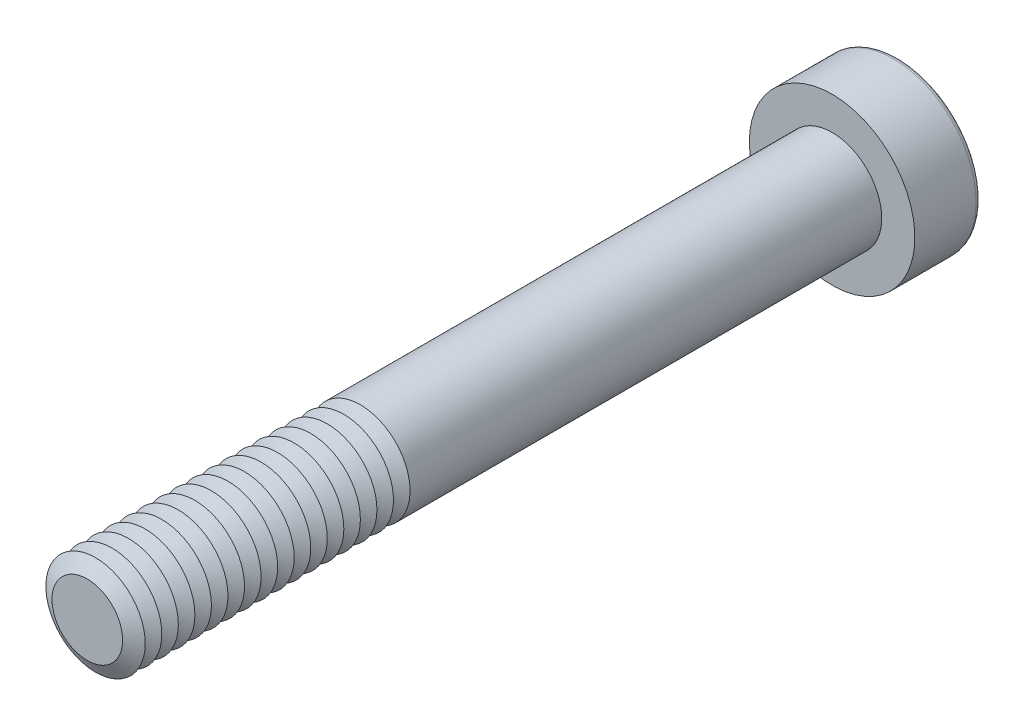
ISO-10303-21;
HEADER;
FILE_DESCRIPTION(('STEP AP214'),'2;1');
FILE_NAME('part.step','',(''),(''),'','','');
FILE_SCHEMA(('AUTOMOTIVE_DESIGN { 1 0 10303 214 1 1 1 1 }'));
ENDSEC;
DATA;
#1=APPLICATION_CONTEXT('core data for automotive mechanical design processes');
#2=APPLICATION_PROTOCOL_DEFINITION('international standard','automotive_design',2000,#1);
#3=PRODUCT_CONTEXT('',#1,'mechanical');
#4=PRODUCT('Part','Part','',(#3));
#5=PRODUCT_RELATED_PRODUCT_CATEGORY('part','',(#4));
#6=PRODUCT_DEFINITION_FORMATION('','',#4);
#7=PRODUCT_DEFINITION_CONTEXT('part definition',#1,'design');
#8=PRODUCT_DEFINITION('design','',#6,#7);
#9=PRODUCT_DEFINITION_SHAPE('','',#8);
#10=(LENGTH_UNIT() NAMED_UNIT(*) SI_UNIT(.MILLI.,.METRE.));
#11=(NAMED_UNIT(*) PLANE_ANGLE_UNIT() SI_UNIT($,.RADIAN.));
#12=(NAMED_UNIT(*) SI_UNIT($,.STERADIAN.) SOLID_ANGLE_UNIT());
#13=UNCERTAINTY_MEASURE_WITH_UNIT(LENGTH_MEASURE(1.E-05),#10,'distance_accuracy_value','');
#14=(GEOMETRIC_REPRESENTATION_CONTEXT(3) GLOBAL_UNCERTAINTY_ASSIGNED_CONTEXT((#13)) GLOBAL_UNIT_ASSIGNED_CONTEXT((#10,
#11,#12)) REPRESENTATION_CONTEXT('',''));
#15=CARTESIAN_POINT('',(0.,0.,0.));
#16=DIRECTION('',(0.,0.,1.));
#17=DIRECTION('',(1.,0.,0.));
#18=AXIS2_PLACEMENT_3D('',#15,#16,#17);
#19=CARTESIAN_POINT('',(0.,0.,41.5));
#20=DIRECTION('',(0.,0.,1.));
#21=DIRECTION('',(1.,0.,0.));
#22=AXIS2_PLACEMENT_3D('',#19,#20,#21);
#23=CONICAL_SURFACE('',#22,3.,1.0471975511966);
#24=CARTESIAN_POINT('',(0.,0.,41.));
#25=DIRECTION('',(0.,0.,1.));
#26=DIRECTION('',(1.,0.,0.));
#27=AXIS2_PLACEMENT_3D('',#24,#25,#26);
#28=CIRCLE('',#27,2.13397459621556);
#29=CARTESIAN_POINT('',(2.13397459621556,0.,41.));
#30=VERTEX_POINT('',#29);
#31=EDGE_CURVE('E314',#30,#30,#28,.T.);
#32=ORIENTED_EDGE('',*,*,#31,.T.);
#33=EDGE_LOOP('',(#32));
#34=FACE_BOUND('',#33,.T.);
#35=CARTESIAN_POINT('',(0.,0.,41.5));
#36=DIRECTION('',(0.,0.,1.));
#37=DIRECTION('',(1.,0.,0.));
#38=AXIS2_PLACEMENT_3D('',#35,#36,#37);
#39=CIRCLE('',#38,3.);
#40=CARTESIAN_POINT('',(3.,0.,41.5));
#41=VERTEX_POINT('',#40);
#42=EDGE_CURVE('E317',#41,#41,#39,.T.);
#43=ORIENTED_EDGE('',*,*,#42,.F.);
#44=EDGE_LOOP('',(#43));
#45=FACE_BOUND('',#44,.T.);
#46=ADVANCED_FACE('F39',(#34,#45),#23,.T.);
#47=CARTESIAN_POINT('',(0.,0.,41.));
#48=DIRECTION('',(0.,0.,-1.));
#49=DIRECTION('',(-1.,0.,0.));
#50=AXIS2_PLACEMENT_3D('',#47,#48,#49);
#51=CONICAL_SURFACE('',#50,2.13397459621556,1.0471975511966);
#52=CARTESIAN_POINT('',(0.,0.,40.5));
#53=DIRECTION('',(0.,0.,1.));
#54=DIRECTION('',(1.,0.,0.));
#55=AXIS2_PLACEMENT_3D('',#52,#53,#54);
#56=CIRCLE('',#55,3.);
#57=CARTESIAN_POINT('',(3.,0.,40.5));
#58=VERTEX_POINT('',#57);
#59=EDGE_CURVE('E325',#58,#58,#56,.T.);
#60=ORIENTED_EDGE('',*,*,#59,.T.);
#61=EDGE_LOOP('',(#60));
#62=FACE_BOUND('',#61,.T.);
#63=ORIENTED_EDGE('',*,*,#31,.F.);
#64=EDGE_LOOP('',(#63));
#65=FACE_BOUND('',#64,.T.);
#66=ADVANCED_FACE('F245',(#62,#65),#51,.T.);
#67=CARTESIAN_POINT('',(0.,0.,45.));
#68=DIRECTION('',(0.,0.,1.));
#69=DIRECTION('',(1.,0.,0.));
#70=AXIS2_PLACEMENT_3D('',#67,#68,#69);
#71=PLANE('',#70);
#72=CARTESIAN_POINT('',(0.,0.,45.));
#73=DIRECTION('',(0.,0.,1.));
#74=DIRECTION('',(1.,0.,0.));
#75=AXIS2_PLACEMENT_3D('',#72,#73,#74);
#76=CIRCLE('',#75,2.13397459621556);
#77=CARTESIAN_POINT('',(2.13397459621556,0.,45.));
#78=VERTEX_POINT('',#77);
#79=EDGE_CURVE('E174',#78,#78,#76,.T.);
#80=ORIENTED_EDGE('',*,*,#79,.T.);
#81=EDGE_LOOP('',(#80));
#82=FACE_BOUND('',#81,.T.);
#83=ADVANCED_FACE('F251',(#82),#71,.T.);
#84=CARTESIAN_POINT('',(0.,0.,45.));
#85=DIRECTION('',(0.,0.,-1.));
#86=DIRECTION('',(-1.,0.,0.));
#87=AXIS2_PLACEMENT_3D('',#84,#85,#86);
#88=CONICAL_SURFACE('',#87,2.13397459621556,1.0471975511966);
#89=CARTESIAN_POINT('',(0.,0.,44.5));
#90=DIRECTION('',(0.,0.,1.));
#91=DIRECTION('',(1.,0.,0.));
#92=AXIS2_PLACEMENT_3D('',#89,#90,#91);
#93=CIRCLE('',#92,3.);
#94=CARTESIAN_POINT('',(3.,0.,44.5));
#95=VERTEX_POINT('',#94);
#96=EDGE_CURVE('E291',#95,#95,#93,.T.);
#97=ORIENTED_EDGE('',*,*,#96,.T.);
#98=EDGE_LOOP('',(#97));
#99=FACE_BOUND('',#98,.T.);
#100=ORIENTED_EDGE('',*,*,#79,.F.);
#101=EDGE_LOOP('',(#100));
#102=FACE_BOUND('',#101,.T.);
#103=ADVANCED_FACE('F199',(#99,#102),#88,.T.);
#104=CARTESIAN_POINT('',(0.,0.,44.5));
#105=DIRECTION('',(0.,0.,1.));
#106=DIRECTION('',(1.,0.,0.));
#107=AXIS2_PLACEMENT_3D('',#104,#105,#106);
#108=CONICAL_SURFACE('',#107,3.,1.0471975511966);
#109=CARTESIAN_POINT('',(0.,0.,44.));
#110=DIRECTION('',(0.,0.,1.));
#111=DIRECTION('',(1.,0.,0.));
#112=AXIS2_PLACEMENT_3D('',#109,#110,#111);
#113=CIRCLE('',#112,2.13397459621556);
#114=CARTESIAN_POINT('',(2.13397459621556,0.,44.));
#115=VERTEX_POINT('',#114);
#116=EDGE_CURVE('E288',#115,#115,#113,.T.);
#117=ORIENTED_EDGE('',*,*,#116,.T.);
#118=EDGE_LOOP('',(#117));
#119=FACE_BOUND('',#118,.T.);
#120=ORIENTED_EDGE('',*,*,#96,.F.);
#121=EDGE_LOOP('',(#120));
#122=FACE_BOUND('',#121,.T.);
#123=ADVANCED_FACE('F277',(#119,#122),#108,.T.);
#124=CARTESIAN_POINT('',(0.,0.,44.));
#125=DIRECTION('',(0.,0.,-1.));
#126=DIRECTION('',(-1.,0.,0.));
#127=AXIS2_PLACEMENT_3D('',#124,#125,#126);
#128=CONICAL_SURFACE('',#127,2.13397459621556,1.0471975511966);
#129=CARTESIAN_POINT('',(0.,0.,43.5));
#130=DIRECTION('',(0.,0.,1.));
#131=DIRECTION('',(1.,0.,0.));
#132=AXIS2_PLACEMENT_3D('',#129,#130,#131);
#133=CIRCLE('',#132,3.);
#134=CARTESIAN_POINT('',(3.,0.,43.5));
#135=VERTEX_POINT('',#134);
#136=EDGE_CURVE('E300',#135,#135,#133,.T.);
#137=ORIENTED_EDGE('',*,*,#136,.T.);
#138=EDGE_LOOP('',(#137));
#139=FACE_BOUND('',#138,.T.);
#140=ORIENTED_EDGE('',*,*,#116,.F.);
#141=EDGE_LOOP('',(#140));
#142=FACE_BOUND('',#141,.T.);
#143=ADVANCED_FACE('F274',(#139,#142),#128,.T.);
#144=CARTESIAN_POINT('',(0.,0.,43.5));
#145=DIRECTION('',(0.,0.,1.));
#146=DIRECTION('',(1.,0.,0.));
#147=AXIS2_PLACEMENT_3D('',#144,#145,#146);
#148=CONICAL_SURFACE('',#147,3.,1.0471975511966);
#149=CARTESIAN_POINT('',(0.,0.,43.));
#150=DIRECTION('',(0.,0.,1.));
#151=DIRECTION('',(1.,0.,0.));
#152=AXIS2_PLACEMENT_3D('',#149,#150,#151);
#153=CIRCLE('',#152,2.13397459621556);
#154=CARTESIAN_POINT('',(2.13397459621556,0.,43.));
#155=VERTEX_POINT('',#154);
#156=EDGE_CURVE('E293',#155,#155,#153,.T.);
#157=ORIENTED_EDGE('',*,*,#156,.T.);
#158=EDGE_LOOP('',(#157));
#159=FACE_BOUND('',#158,.T.);
#160=ORIENTED_EDGE('',*,*,#136,.F.);
#161=EDGE_LOOP('',(#160));
#162=FACE_BOUND('',#161,.T.);
#163=ADVANCED_FACE('F270',(#159,#162),#148,.T.);
#164=CARTESIAN_POINT('',(0.,0.,43.));
#165=DIRECTION('',(0.,0.,-1.));
#166=DIRECTION('',(-1.,0.,0.));
#167=AXIS2_PLACEMENT_3D('',#164,#165,#166);
#168=CONICAL_SURFACE('',#167,2.13397459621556,1.0471975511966);
#169=CARTESIAN_POINT('',(0.,0.,42.5));
#170=DIRECTION('',(0.,0.,1.));
#171=DIRECTION('',(1.,0.,0.));
#172=AXIS2_PLACEMENT_3D('',#169,#170,#171);
#173=CIRCLE('',#172,3.);
#174=CARTESIAN_POINT('',(3.,0.,42.5));
#175=VERTEX_POINT('',#174);
#176=EDGE_CURVE('E310',#175,#175,#173,.T.);
#177=ORIENTED_EDGE('',*,*,#176,.T.);
#178=EDGE_LOOP('',(#177));
#179=FACE_BOUND('',#178,.T.);
#180=ORIENTED_EDGE('',*,*,#156,.F.);
#181=EDGE_LOOP('',(#180));
#182=FACE_BOUND('',#181,.T.);
#183=ADVANCED_FACE('F266',(#179,#182),#168,.T.);
#184=CARTESIAN_POINT('',(0.,0.,42.5));
#185=DIRECTION('',(0.,0.,1.));
#186=DIRECTION('',(1.,0.,0.));
#187=AXIS2_PLACEMENT_3D('',#184,#185,#186);
#188=CONICAL_SURFACE('',#187,3.,1.0471975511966);
#189=CARTESIAN_POINT('',(0.,0.,42.));
#190=DIRECTION('',(0.,0.,1.));
#191=DIRECTION('',(1.,0.,0.));
#192=AXIS2_PLACEMENT_3D('',#189,#190,#191);
#193=CIRCLE('',#192,2.13397459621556);
#194=CARTESIAN_POINT('',(2.13397459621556,0.,42.));
#195=VERTEX_POINT('',#194);
#196=EDGE_CURVE('E306',#195,#195,#193,.T.);
#197=ORIENTED_EDGE('',*,*,#196,.T.);
#198=EDGE_LOOP('',(#197));
#199=FACE_BOUND('',#198,.T.);
#200=ORIENTED_EDGE('',*,*,#176,.F.);
#201=EDGE_LOOP('',(#200));
#202=FACE_BOUND('',#201,.T.);
#203=ADVANCED_FACE('F262',(#199,#202),#188,.T.);
#204=CARTESIAN_POINT('',(0.,0.,42.));
#205=DIRECTION('',(0.,0.,-1.));
#206=DIRECTION('',(-1.,0.,0.));
#207=AXIS2_PLACEMENT_3D('',#204,#205,#206);
#208=CONICAL_SURFACE('',#207,2.13397459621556,1.0471975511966);
#209=ORIENTED_EDGE('',*,*,#42,.T.);
#210=EDGE_LOOP('',(#209));
#211=FACE_BOUND('',#210,.T.);
#212=ORIENTED_EDGE('',*,*,#196,.F.);
#213=EDGE_LOOP('',(#212));
#214=FACE_BOUND('',#213,.T.);
#215=ADVANCED_FACE('F258',(#211,#214),#208,.T.);
#216=CARTESIAN_POINT('',(0.,0.,40.5));
#217=DIRECTION('',(0.,0.,1.));
#218=DIRECTION('',(1.,0.,0.));
#219=AXIS2_PLACEMENT_3D('',#216,#217,#218);
#220=CONICAL_SURFACE('',#219,3.,1.0471975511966);
#221=CARTESIAN_POINT('',(0.,0.,40.));
#222=DIRECTION('',(0.,0.,1.));
#223=DIRECTION('',(1.,0.,0.));
#224=AXIS2_PLACEMENT_3D('',#221,#222,#223);
#225=CIRCLE('',#224,2.13397459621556);
#226=CARTESIAN_POINT('',(2.13397459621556,0.,40.));
#227=VERTEX_POINT('',#226);
#228=EDGE_CURVE('E321',#227,#227,#225,.T.);
#229=ORIENTED_EDGE('',*,*,#228,.T.);
#230=EDGE_LOOP('',(#229));
#231=FACE_BOUND('',#230,.T.);
#232=ORIENTED_EDGE('',*,*,#59,.F.);
#233=EDGE_LOOP('',(#232));
#234=FACE_BOUND('',#233,.T.);
#235=ADVANCED_FACE('F261',(#231,#234),#220,.T.);
#236=CARTESIAN_POINT('',(0.,0.,40.));
#237=DIRECTION('',(0.,0.,-1.));
#238=DIRECTION('',(-1.,0.,0.));
#239=AXIS2_PLACEMENT_3D('',#236,#237,#238);
#240=CONICAL_SURFACE('',#239,2.13397459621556,1.0471975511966);
#241=CARTESIAN_POINT('',(0.,0.,39.5));
#242=DIRECTION('',(0.,0.,1.));
#243=DIRECTION('',(1.,0.,0.));
#244=AXIS2_PLACEMENT_3D('',#241,#242,#243);
#245=CIRCLE('',#244,3.);
#246=CARTESIAN_POINT('',(3.,0.,39.5));
#247=VERTEX_POINT('',#246);
#248=EDGE_CURVE('E333',#247,#247,#245,.T.);
#249=ORIENTED_EDGE('',*,*,#248,.T.);
#250=EDGE_LOOP('',(#249));
#251=FACE_BOUND('',#250,.T.);
#252=ORIENTED_EDGE('',*,*,#228,.F.);
#253=EDGE_LOOP('',(#252));
#254=FACE_BOUND('',#253,.T.);
#255=ADVANCED_FACE('F513',(#251,#254),#240,.T.);
#256=CARTESIAN_POINT('',(0.,0.,39.5));
#257=DIRECTION('',(0.,0.,1.));
#258=DIRECTION('',(1.,0.,0.));
#259=AXIS2_PLACEMENT_3D('',#256,#257,#258);
#260=CONICAL_SURFACE('',#259,3.,1.0471975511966);
#261=CARTESIAN_POINT('',(0.,0.,39.));
#262=DIRECTION('',(0.,0.,1.));
#263=DIRECTION('',(1.,0.,0.));
#264=AXIS2_PLACEMENT_3D('',#261,#262,#263);
#265=CIRCLE('',#264,2.13397459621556);
#266=CARTESIAN_POINT('',(2.13397459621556,0.,39.));
#267=VERTEX_POINT('',#266);
#268=EDGE_CURVE('E329',#267,#267,#265,.T.);
#269=ORIENTED_EDGE('',*,*,#268,.T.);
#270=EDGE_LOOP('',(#269));
#271=FACE_BOUND('',#270,.T.);
#272=ORIENTED_EDGE('',*,*,#248,.F.);
#273=EDGE_LOOP('',(#272));
#274=FACE_BOUND('',#273,.T.);
#275=ADVANCED_FACE('F509',(#271,#274),#260,.T.);
#276=CARTESIAN_POINT('',(0.,0.,39.));
#277=DIRECTION('',(0.,0.,-1.));
#278=DIRECTION('',(-1.,0.,0.));
#279=AXIS2_PLACEMENT_3D('',#276,#277,#278);
#280=CONICAL_SURFACE('',#279,2.13397459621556,1.0471975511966);
#281=CARTESIAN_POINT('',(0.,0.,38.5));
#282=DIRECTION('',(0.,0.,1.));
#283=DIRECTION('',(1.,0.,0.));
#284=AXIS2_PLACEMENT_3D('',#281,#282,#283);
#285=CIRCLE('',#284,3.);
#286=CARTESIAN_POINT('',(3.,0.,38.5));
#287=VERTEX_POINT('',#286);
#288=EDGE_CURVE('E341',#287,#287,#285,.T.);
#289=ORIENTED_EDGE('',*,*,#288,.T.);
#290=EDGE_LOOP('',(#289));
#291=FACE_BOUND('',#290,.T.);
#292=ORIENTED_EDGE('',*,*,#268,.F.);
#293=EDGE_LOOP('',(#292));
#294=FACE_BOUND('',#293,.T.);
#295=ADVANCED_FACE('F505',(#291,#294),#280,.T.);
#296=CARTESIAN_POINT('',(0.,0.,38.5));
#297=DIRECTION('',(0.,0.,1.));
#298=DIRECTION('',(1.,0.,0.));
#299=AXIS2_PLACEMENT_3D('',#296,#297,#298);
#300=CONICAL_SURFACE('',#299,3.,1.0471975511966);
#301=CARTESIAN_POINT('',(0.,0.,38.));
#302=DIRECTION('',(0.,0.,1.));
#303=DIRECTION('',(1.,0.,0.));
#304=AXIS2_PLACEMENT_3D('',#301,#302,#303);
#305=CIRCLE('',#304,2.13397459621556);
#306=CARTESIAN_POINT('',(2.13397459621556,0.,38.));
#307=VERTEX_POINT('',#306);
#308=EDGE_CURVE('E337',#307,#307,#305,.T.);
#309=ORIENTED_EDGE('',*,*,#308,.T.);
#310=EDGE_LOOP('',(#309));
#311=FACE_BOUND('',#310,.T.);
#312=ORIENTED_EDGE('',*,*,#288,.F.);
#313=EDGE_LOOP('',(#312));
#314=FACE_BOUND('',#313,.T.);
#315=ADVANCED_FACE('F501',(#311,#314),#300,.T.);
#316=CARTESIAN_POINT('',(0.,0.,38.));
#317=DIRECTION('',(0.,0.,-1.));
#318=DIRECTION('',(-1.,0.,0.));
#319=AXIS2_PLACEMENT_3D('',#316,#317,#318);
#320=CONICAL_SURFACE('',#319,2.13397459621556,1.0471975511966);
#321=CARTESIAN_POINT('',(0.,0.,37.5));
#322=DIRECTION('',(0.,0.,1.));
#323=DIRECTION('',(1.,0.,0.));
#324=AXIS2_PLACEMENT_3D('',#321,#322,#323);
#325=CIRCLE('',#324,3.);
#326=CARTESIAN_POINT('',(3.,0.,37.5));
#327=VERTEX_POINT('',#326);
#328=EDGE_CURVE('E349',#327,#327,#325,.T.);
#329=ORIENTED_EDGE('',*,*,#328,.T.);
#330=EDGE_LOOP('',(#329));
#331=FACE_BOUND('',#330,.T.);
#332=ORIENTED_EDGE('',*,*,#308,.F.);
#333=EDGE_LOOP('',(#332));
#334=FACE_BOUND('',#333,.T.);
#335=ADVANCED_FACE('F497',(#331,#334),#320,.T.);
#336=CARTESIAN_POINT('',(0.,0.,37.5));
#337=DIRECTION('',(0.,0.,1.));
#338=DIRECTION('',(1.,0.,0.));
#339=AXIS2_PLACEMENT_3D('',#336,#337,#338);
#340=CONICAL_SURFACE('',#339,3.,1.0471975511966);
#341=CARTESIAN_POINT('',(0.,0.,37.));
#342=DIRECTION('',(0.,0.,1.));
#343=DIRECTION('',(1.,0.,0.));
#344=AXIS2_PLACEMENT_3D('',#341,#342,#343);
#345=CIRCLE('',#344,2.13397459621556);
#346=CARTESIAN_POINT('',(2.13397459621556,0.,37.));
#347=VERTEX_POINT('',#346);
#348=EDGE_CURVE('E345',#347,#347,#345,.T.);
#349=ORIENTED_EDGE('',*,*,#348,.T.);
#350=EDGE_LOOP('',(#349));
#351=FACE_BOUND('',#350,.T.);
#352=ORIENTED_EDGE('',*,*,#328,.F.);
#353=EDGE_LOOP('',(#352));
#354=FACE_BOUND('',#353,.T.);
#355=ADVANCED_FACE('F493',(#351,#354),#340,.T.);
#356=CARTESIAN_POINT('',(0.,0.,37.));
#357=DIRECTION('',(0.,0.,-1.));
#358=DIRECTION('',(-1.,0.,0.));
#359=AXIS2_PLACEMENT_3D('',#356,#357,#358);
#360=CONICAL_SURFACE('',#359,2.13397459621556,1.0471975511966);
#361=CARTESIAN_POINT('',(0.,0.,36.5));
#362=DIRECTION('',(0.,0.,1.));
#363=DIRECTION('',(1.,0.,0.));
#364=AXIS2_PLACEMENT_3D('',#361,#362,#363);
#365=CIRCLE('',#364,3.);
#366=CARTESIAN_POINT('',(3.,0.,36.5));
#367=VERTEX_POINT('',#366);
#368=EDGE_CURVE('E357',#367,#367,#365,.T.);
#369=ORIENTED_EDGE('',*,*,#368,.T.);
#370=EDGE_LOOP('',(#369));
#371=FACE_BOUND('',#370,.T.);
#372=ORIENTED_EDGE('',*,*,#348,.F.);
#373=EDGE_LOOP('',(#372));
#374=FACE_BOUND('',#373,.T.);
#375=ADVANCED_FACE('F489',(#371,#374),#360,.T.);
#376=CARTESIAN_POINT('',(0.,0.,36.5));
#377=DIRECTION('',(0.,0.,1.));
#378=DIRECTION('',(1.,0.,0.));
#379=AXIS2_PLACEMENT_3D('',#376,#377,#378);
#380=CONICAL_SURFACE('',#379,3.,1.0471975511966);
#381=CARTESIAN_POINT('',(0.,0.,36.));
#382=DIRECTION('',(0.,0.,1.));
#383=DIRECTION('',(1.,0.,0.));
#384=AXIS2_PLACEMENT_3D('',#381,#382,#383);
#385=CIRCLE('',#384,2.13397459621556);
#386=CARTESIAN_POINT('',(2.13397459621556,0.,36.));
#387=VERTEX_POINT('',#386);
#388=EDGE_CURVE('E353',#387,#387,#385,.T.);
#389=ORIENTED_EDGE('',*,*,#388,.T.);
#390=EDGE_LOOP('',(#389));
#391=FACE_BOUND('',#390,.T.);
#392=ORIENTED_EDGE('',*,*,#368,.F.);
#393=EDGE_LOOP('',(#392));
#394=FACE_BOUND('',#393,.T.);
#395=ADVANCED_FACE('F485',(#391,#394),#380,.T.);
#396=CARTESIAN_POINT('',(0.,0.,36.));
#397=DIRECTION('',(0.,0.,-1.));
#398=DIRECTION('',(-1.,0.,0.));
#399=AXIS2_PLACEMENT_3D('',#396,#397,#398);
#400=CONICAL_SURFACE('',#399,2.13397459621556,1.0471975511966);
#401=CARTESIAN_POINT('',(0.,0.,35.5));
#402=DIRECTION('',(0.,0.,1.));
#403=DIRECTION('',(1.,0.,0.));
#404=AXIS2_PLACEMENT_3D('',#401,#402,#403);
#405=CIRCLE('',#404,3.);
#406=CARTESIAN_POINT('',(3.,0.,35.5));
#407=VERTEX_POINT('',#406);
#408=EDGE_CURVE('E365',#407,#407,#405,.T.);
#409=ORIENTED_EDGE('',*,*,#408,.T.);
#410=EDGE_LOOP('',(#409));
#411=FACE_BOUND('',#410,.T.);
#412=ORIENTED_EDGE('',*,*,#388,.F.);
#413=EDGE_LOOP('',(#412));
#414=FACE_BOUND('',#413,.T.);
#415=ADVANCED_FACE('F481',(#411,#414),#400,.T.);
#416=CARTESIAN_POINT('',(0.,0.,35.5));
#417=DIRECTION('',(0.,0.,1.));
#418=DIRECTION('',(1.,0.,0.));
#419=AXIS2_PLACEMENT_3D('',#416,#417,#418);
#420=CONICAL_SURFACE('',#419,3.,1.0471975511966);
#421=CARTESIAN_POINT('',(0.,0.,35.));
#422=DIRECTION('',(0.,0.,1.));
#423=DIRECTION('',(1.,0.,0.));
#424=AXIS2_PLACEMENT_3D('',#421,#422,#423);
#425=CIRCLE('',#424,2.13397459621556);
#426=CARTESIAN_POINT('',(2.13397459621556,0.,35.));
#427=VERTEX_POINT('',#426);
#428=EDGE_CURVE('E361',#427,#427,#425,.T.);
#429=ORIENTED_EDGE('',*,*,#428,.T.);
#430=EDGE_LOOP('',(#429));
#431=FACE_BOUND('',#430,.T.);
#432=ORIENTED_EDGE('',*,*,#408,.F.);
#433=EDGE_LOOP('',(#432));
#434=FACE_BOUND('',#433,.T.);
#435=ADVANCED_FACE('F477',(#431,#434),#420,.T.);
#436=CARTESIAN_POINT('',(0.,0.,35.));
#437=DIRECTION('',(0.,0.,-1.));
#438=DIRECTION('',(-1.,0.,0.));
#439=AXIS2_PLACEMENT_3D('',#436,#437,#438);
#440=CONICAL_SURFACE('',#439,2.13397459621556,1.0471975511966);
#441=CARTESIAN_POINT('',(0.,0.,34.5));
#442=DIRECTION('',(0.,0.,1.));
#443=DIRECTION('',(1.,0.,0.));
#444=AXIS2_PLACEMENT_3D('',#441,#442,#443);
#445=CIRCLE('',#444,3.);
#446=CARTESIAN_POINT('',(3.,0.,34.5));
#447=VERTEX_POINT('',#446);
#448=EDGE_CURVE('E372',#447,#447,#445,.T.);
#449=ORIENTED_EDGE('',*,*,#448,.T.);
#450=EDGE_LOOP('',(#449));
#451=FACE_BOUND('',#450,.T.);
#452=ORIENTED_EDGE('',*,*,#428,.F.);
#453=EDGE_LOOP('',(#452));
#454=FACE_BOUND('',#453,.T.);
#455=ADVANCED_FACE('F473',(#451,#454),#440,.T.);
#456=CARTESIAN_POINT('',(0.,0.,34.5));
#457=DIRECTION('',(0.,0.,1.));
#458=DIRECTION('',(1.,0.,0.));
#459=AXIS2_PLACEMENT_3D('',#456,#457,#458);
#460=CONICAL_SURFACE('',#459,3.,1.0471975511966);
#461=CARTESIAN_POINT('',(0.,0.,34.));
#462=DIRECTION('',(0.,0.,1.));
#463=DIRECTION('',(1.,0.,0.));
#464=AXIS2_PLACEMENT_3D('',#461,#462,#463);
#465=CIRCLE('',#464,2.13397459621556);
#466=CARTESIAN_POINT('',(2.13397459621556,0.,34.));
#467=VERTEX_POINT('',#466);
#468=EDGE_CURVE('E369',#467,#467,#465,.T.);
#469=ORIENTED_EDGE('',*,*,#468,.T.);
#470=EDGE_LOOP('',(#469));
#471=FACE_BOUND('',#470,.T.);
#472=ORIENTED_EDGE('',*,*,#448,.F.);
#473=EDGE_LOOP('',(#472));
#474=FACE_BOUND('',#473,.T.);
#475=ADVANCED_FACE('F469',(#471,#474),#460,.T.);
#476=CARTESIAN_POINT('',(0.,0.,34.));
#477=DIRECTION('',(0.,0.,-1.));
#478=DIRECTION('',(-1.,0.,0.));
#479=AXIS2_PLACEMENT_3D('',#476,#477,#478);
#480=CONICAL_SURFACE('',#479,2.13397459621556,1.0471975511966);
#481=CARTESIAN_POINT('',(0.,0.,33.5));
#482=DIRECTION('',(0.,0.,1.));
#483=DIRECTION('',(1.,0.,0.));
#484=AXIS2_PLACEMENT_3D('',#481,#482,#483);
#485=CIRCLE('',#484,3.);
#486=CARTESIAN_POINT('',(3.,0.,33.5));
#487=VERTEX_POINT('',#486);
#488=EDGE_CURVE('E380',#487,#487,#485,.T.);
#489=ORIENTED_EDGE('',*,*,#488,.T.);
#490=EDGE_LOOP('',(#489));
#491=FACE_BOUND('',#490,.T.);
#492=ORIENTED_EDGE('',*,*,#468,.F.);
#493=EDGE_LOOP('',(#492));
#494=FACE_BOUND('',#493,.T.);
#495=ADVANCED_FACE('F465',(#491,#494),#480,.T.);
#496=CARTESIAN_POINT('',(0.,0.,33.5));
#497=DIRECTION('',(0.,0.,1.));
#498=DIRECTION('',(1.,0.,0.));
#499=AXIS2_PLACEMENT_3D('',#496,#497,#498);
#500=CONICAL_SURFACE('',#499,3.,1.0471975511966);
#501=CARTESIAN_POINT('',(0.,0.,33.));
#502=DIRECTION('',(0.,0.,1.));
#503=DIRECTION('',(1.,0.,0.));
#504=AXIS2_PLACEMENT_3D('',#501,#502,#503);
#505=CIRCLE('',#504,2.13397459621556);
#506=CARTESIAN_POINT('',(2.13397459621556,0.,33.));
#507=VERTEX_POINT('',#506);
#508=EDGE_CURVE('E376',#507,#507,#505,.T.);
#509=ORIENTED_EDGE('',*,*,#508,.T.);
#510=EDGE_LOOP('',(#509));
#511=FACE_BOUND('',#510,.T.);
#512=ORIENTED_EDGE('',*,*,#488,.F.);
#513=EDGE_LOOP('',(#512));
#514=FACE_BOUND('',#513,.T.);
#515=ADVANCED_FACE('F461',(#511,#514),#500,.T.);
#516=CARTESIAN_POINT('',(0.,0.,33.));
#517=DIRECTION('',(0.,0.,-1.));
#518=DIRECTION('',(-1.,0.,0.));
#519=AXIS2_PLACEMENT_3D('',#516,#517,#518);
#520=CONICAL_SURFACE('',#519,2.13397459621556,1.0471975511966);
#521=CARTESIAN_POINT('',(0.,0.,32.5));
#522=DIRECTION('',(0.,0.,1.));
#523=DIRECTION('',(1.,0.,0.));
#524=AXIS2_PLACEMENT_3D('',#521,#522,#523);
#525=CIRCLE('',#524,3.);
#526=CARTESIAN_POINT('',(3.,0.,32.5));
#527=VERTEX_POINT('',#526);
#528=EDGE_CURVE('E388',#527,#527,#525,.T.);
#529=ORIENTED_EDGE('',*,*,#528,.T.);
#530=EDGE_LOOP('',(#529));
#531=FACE_BOUND('',#530,.T.);
#532=ORIENTED_EDGE('',*,*,#508,.F.);
#533=EDGE_LOOP('',(#532));
#534=FACE_BOUND('',#533,.T.);
#535=ADVANCED_FACE('F457',(#531,#534),#520,.T.);
#536=CARTESIAN_POINT('',(0.,0.,32.5));
#537=DIRECTION('',(0.,0.,1.));
#538=DIRECTION('',(1.,0.,0.));
#539=AXIS2_PLACEMENT_3D('',#536,#537,#538);
#540=CONICAL_SURFACE('',#539,3.,1.0471975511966);
#541=CARTESIAN_POINT('',(0.,0.,32.));
#542=DIRECTION('',(0.,0.,1.));
#543=DIRECTION('',(1.,0.,0.));
#544=AXIS2_PLACEMENT_3D('',#541,#542,#543);
#545=CIRCLE('',#544,2.13397459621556);
#546=CARTESIAN_POINT('',(2.13397459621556,0.,32.));
#547=VERTEX_POINT('',#546);
#548=EDGE_CURVE('E384',#547,#547,#545,.T.);
#549=ORIENTED_EDGE('',*,*,#548,.T.);
#550=EDGE_LOOP('',(#549));
#551=FACE_BOUND('',#550,.T.);
#552=ORIENTED_EDGE('',*,*,#528,.F.);
#553=EDGE_LOOP('',(#552));
#554=FACE_BOUND('',#553,.T.);
#555=ADVANCED_FACE('F453',(#551,#554),#540,.T.);
#556=CARTESIAN_POINT('',(0.,0.,32.));
#557=DIRECTION('',(0.,0.,-1.));
#558=DIRECTION('',(-1.,0.,0.));
#559=AXIS2_PLACEMENT_3D('',#556,#557,#558);
#560=CONICAL_SURFACE('',#559,2.13397459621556,1.0471975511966);
#561=CARTESIAN_POINT('',(0.,0.,31.5));
#562=DIRECTION('',(0.,0.,1.));
#563=DIRECTION('',(1.,0.,0.));
#564=AXIS2_PLACEMENT_3D('',#561,#562,#563);
#565=CIRCLE('',#564,3.);
#566=CARTESIAN_POINT('',(3.,0.,31.5));
#567=VERTEX_POINT('',#566);
#568=EDGE_CURVE('E396',#567,#567,#565,.T.);
#569=ORIENTED_EDGE('',*,*,#568,.T.);
#570=EDGE_LOOP('',(#569));
#571=FACE_BOUND('',#570,.T.);
#572=ORIENTED_EDGE('',*,*,#548,.F.);
#573=EDGE_LOOP('',(#572));
#574=FACE_BOUND('',#573,.T.);
#575=ADVANCED_FACE('F449',(#571,#574),#560,.T.);
#576=CARTESIAN_POINT('',(0.,0.,31.5));
#577=DIRECTION('',(0.,0.,1.));
#578=DIRECTION('',(1.,0.,0.));
#579=AXIS2_PLACEMENT_3D('',#576,#577,#578);
#580=CONICAL_SURFACE('',#579,3.,1.0471975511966);
#581=CARTESIAN_POINT('',(0.,0.,31.));
#582=DIRECTION('',(0.,0.,1.));
#583=DIRECTION('',(1.,0.,0.));
#584=AXIS2_PLACEMENT_3D('',#581,#582,#583);
#585=CIRCLE('',#584,2.13397459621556);
#586=CARTESIAN_POINT('',(2.13397459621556,0.,31.));
#587=VERTEX_POINT('',#586);
#588=EDGE_CURVE('E392',#587,#587,#585,.T.);
#589=ORIENTED_EDGE('',*,*,#588,.T.);
#590=EDGE_LOOP('',(#589));
#591=FACE_BOUND('',#590,.T.);
#592=ORIENTED_EDGE('',*,*,#568,.F.);
#593=EDGE_LOOP('',(#592));
#594=FACE_BOUND('',#593,.T.);
#595=ADVANCED_FACE('F445',(#591,#594),#580,.T.);
#596=CARTESIAN_POINT('',(0.,0.,31.));
#597=DIRECTION('',(0.,0.,-1.));
#598=DIRECTION('',(-1.,0.,0.));
#599=AXIS2_PLACEMENT_3D('',#596,#597,#598);
#600=CONICAL_SURFACE('',#599,2.13397459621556,1.0471975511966);
#601=CARTESIAN_POINT('',(0.,0.,30.5));
#602=DIRECTION('',(0.,0.,1.));
#603=DIRECTION('',(1.,0.,0.));
#604=AXIS2_PLACEMENT_3D('',#601,#602,#603);
#605=CIRCLE('',#604,3.);
#606=CARTESIAN_POINT('',(3.,0.,30.5));
#607=VERTEX_POINT('',#606);
#608=EDGE_CURVE('E404',#607,#607,#605,.T.);
#609=ORIENTED_EDGE('',*,*,#608,.T.);
#610=EDGE_LOOP('',(#609));
#611=FACE_BOUND('',#610,.T.);
#612=ORIENTED_EDGE('',*,*,#588,.F.);
#613=EDGE_LOOP('',(#612));
#614=FACE_BOUND('',#613,.T.);
#615=ADVANCED_FACE('F441',(#611,#614),#600,.T.);
#616=CARTESIAN_POINT('',(0.,0.,30.5));
#617=DIRECTION('',(0.,0.,1.));
#618=DIRECTION('',(1.,0.,0.));
#619=AXIS2_PLACEMENT_3D('',#616,#617,#618);
#620=CONICAL_SURFACE('',#619,3.,1.0471975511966);
#621=CARTESIAN_POINT('',(0.,0.,30.));
#622=DIRECTION('',(0.,0.,1.));
#623=DIRECTION('',(1.,0.,0.));
#624=AXIS2_PLACEMENT_3D('',#621,#622,#623);
#625=CIRCLE('',#624,2.13397459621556);
#626=CARTESIAN_POINT('',(2.13397459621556,0.,30.));
#627=VERTEX_POINT('',#626);
#628=EDGE_CURVE('E400',#627,#627,#625,.T.);
#629=ORIENTED_EDGE('',*,*,#628,.T.);
#630=EDGE_LOOP('',(#629));
#631=FACE_BOUND('',#630,.T.);
#632=ORIENTED_EDGE('',*,*,#608,.F.);
#633=EDGE_LOOP('',(#632));
#634=FACE_BOUND('',#633,.T.);
#635=ADVANCED_FACE('F436',(#631,#634),#620,.T.);
#636=CARTESIAN_POINT('',(0.,0.,30.));
#637=DIRECTION('',(0.,0.,-1.));
#638=DIRECTION('',(-1.,0.,0.));
#639=AXIS2_PLACEMENT_3D('',#636,#637,#638);
#640=CONICAL_SURFACE('',#639,2.13397459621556,1.0471975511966);
#641=CARTESIAN_POINT('',(0.,0.,29.5));
#642=DIRECTION('',(0.,0.,1.));
#643=DIRECTION('',(1.,0.,0.));
#644=AXIS2_PLACEMENT_3D('',#641,#642,#643);
#645=CIRCLE('',#644,3.);
#646=CARTESIAN_POINT('',(3.,0.,29.5));
#647=VERTEX_POINT('',#646);
#648=EDGE_CURVE('E416',#647,#647,#645,.T.);
#649=ORIENTED_EDGE('',*,*,#648,.T.);
#650=EDGE_LOOP('',(#649));
#651=FACE_BOUND('',#650,.T.);
#652=ORIENTED_EDGE('',*,*,#628,.F.);
#653=EDGE_LOOP('',(#652));
#654=FACE_BOUND('',#653,.T.);
#655=ADVANCED_FACE('F422',(#651,#654),#640,.T.);
#656=CARTESIAN_POINT('',(0.,0.,29.5));
#657=DIRECTION('',(0.,0.,1.));
#658=DIRECTION('',(1.,0.,0.));
#659=AXIS2_PLACEMENT_3D('',#656,#657,#658);
#660=CONICAL_SURFACE('',#659,3.,1.0471975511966);
#661=CARTESIAN_POINT('',(0.,0.,29.));
#662=DIRECTION('',(0.,0.,1.));
#663=DIRECTION('',(1.,0.,0.));
#664=AXIS2_PLACEMENT_3D('',#661,#662,#663);
#665=CIRCLE('',#664,2.13397459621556);
#666=CARTESIAN_POINT('',(2.13397459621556,0.,29.));
#667=VERTEX_POINT('',#666);
#668=EDGE_CURVE('E408',#667,#667,#665,.T.);
#669=ORIENTED_EDGE('',*,*,#668,.T.);
#670=EDGE_LOOP('',(#669));
#671=FACE_BOUND('',#670,.T.);
#672=ORIENTED_EDGE('',*,*,#648,.F.);
#673=EDGE_LOOP('',(#672));
#674=FACE_BOUND('',#673,.T.);
#675=ADVANCED_FACE('F425',(#671,#674),#660,.T.);
#676=CARTESIAN_POINT('',(0.,0.,29.));
#677=DIRECTION('',(0.,0.,-1.));
#678=DIRECTION('',(-1.,0.,0.));
#679=AXIS2_PLACEMENT_3D('',#676,#677,#678);
#680=CONICAL_SURFACE('',#679,2.13397459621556,1.0471975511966);
#681=CARTESIAN_POINT('',(0.,0.,28.5));
#682=DIRECTION('',(0.,0.,1.));
#683=DIRECTION('',(1.,0.,0.));
#684=AXIS2_PLACEMENT_3D('',#681,#682,#683);
#685=CIRCLE('',#684,3.);
#686=CARTESIAN_POINT('',(-3.,0.,28.5));
#687=VERTEX_POINT('',#686);
#688=EDGE_CURVE('E412',#687,#687,#685,.T.);
#689=ORIENTED_EDGE('',*,*,#688,.T.);
#690=EDGE_LOOP('',(#689));
#691=FACE_BOUND('',#690,.T.);
#692=ORIENTED_EDGE('',*,*,#668,.F.);
#693=EDGE_LOOP('',(#692));
#694=FACE_BOUND('',#693,.T.);
#695=ADVANCED_FACE('F427',(#691,#694),#680,.T.);
#696=CARTESIAN_POINT('',(0.,0.,-1.));
#697=DIRECTION('',(0.,0.,-1.));
#698=DIRECTION('',(-1.,0.,0.));
#699=AXIS2_PLACEMENT_3D('',#696,#697,#698);
#700=CONICAL_SURFACE('',#699,2.,1.0471975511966);
#701=CARTESIAN_POINT('',(0.,0.,0.154700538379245));
#702=VERTEX_POINT('',#701);
#703=VERTEX_LOOP('',#702);
#704=FACE_BOUND('',#703,.T.);
#705=CARTESIAN_POINT('',(0.,0.,-1.));
#706=DIRECTION('',(0.,0.,-1.));
#707=DIRECTION('',(-1.,0.,0.));
#708=AXIS2_PLACEMENT_3D('',#705,#706,#707);
#709=CIRCLE('',#708,2.);
#710=CARTESIAN_POINT('',(-1.73205080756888,0.999999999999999,-1.));
#711=VERTEX_POINT('',#710);
#712=CARTESIAN_POINT('',(0.,2.,-1.));
#713=VERTEX_POINT('',#712);
#714=EDGE_CURVE('E149',#711,#713,#709,.T.);
#715=ORIENTED_EDGE('',*,*,#714,.T.);
#716=CARTESIAN_POINT('',(0.,0.,-1.));
#717=DIRECTION('',(0.,0.,-1.));
#718=DIRECTION('',(-1.,0.,0.));
#719=AXIS2_PLACEMENT_3D('',#716,#717,#718);
#720=CIRCLE('',#719,2.);
#721=CARTESIAN_POINT('',(1.73205080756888,1.,-1.));
#722=VERTEX_POINT('',#721);
#723=EDGE_CURVE('E54',#713,#722,#720,.T.);
#724=ORIENTED_EDGE('',*,*,#723,.T.);
#725=CARTESIAN_POINT('',(1.73205080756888,-0.999999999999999,-1.));
#726=VERTEX_POINT('',#725);
#727=EDGE_CURVE('E1026',#722,#726,#720,.T.);
#728=ORIENTED_EDGE('',*,*,#727,.T.);
#729=CARTESIAN_POINT('',(0.,-2.,-1.));
#730=VERTEX_POINT('',#729);
#731=EDGE_CURVE('E1025',#726,#730,#720,.T.);
#732=ORIENTED_EDGE('',*,*,#731,.T.);
#733=CARTESIAN_POINT('',(-1.73205080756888,-0.999999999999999,-1.));
#734=VERTEX_POINT('',#733);
#735=EDGE_CURVE('E1021',#730,#734,#720,.T.);
#736=ORIENTED_EDGE('',*,*,#735,.T.);
#737=EDGE_CURVE('E1019',#734,#711,#720,.T.);
#738=ORIENTED_EDGE('',*,*,#737,.T.);
#739=EDGE_LOOP('',(#715,#724,#728,#732,#736,#738));
#740=FACE_BOUND('',#739,.T.);
#741=ADVANCED_FACE('F201',(#704,#740),#700,.F.);
#742=CARTESIAN_POINT('',(0.,0.,-1.));
#743=DIRECTION('',(0.,0.,-1.));
#744=DIRECTION('',(-1.,0.,0.));
#745=AXIS2_PLACEMENT_3D('',#742,#743,#744);
#746=PLANE('',#745);
#747=ORIENTED_EDGE('',*,*,#723,.F.);
#748=DIRECTION('',(1.,0.,0.));
#749=VECTOR('',#748,1.);
#750=CARTESIAN_POINT('',(-1.15470053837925,2.,-1.));
#751=LINE('',#750,#749);
#752=CARTESIAN_POINT('',(1.15470053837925,2.,-1.));
#753=VERTEX_POINT('',#752);
#754=EDGE_CURVE('E1063',#713,#753,#751,.T.);
#755=ORIENTED_EDGE('',*,*,#754,.T.);
#756=DIRECTION('',(0.5,-0.866025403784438,0.));
#757=VECTOR('',#756,1.);
#758=CARTESIAN_POINT('',(1.15470053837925,2.,-1.));
#759=LINE('',#758,#757);
#760=EDGE_CURVE('E155',#753,#722,#759,.T.);
#761=ORIENTED_EDGE('',*,*,#760,.T.);
#762=EDGE_LOOP('',(#747,#755,#761));
#763=FACE_BOUND('',#762,.T.);
#764=ADVANCED_FACE('F608',(#763),#746,.T.);
#765=ORIENTED_EDGE('',*,*,#727,.F.);
#766=CARTESIAN_POINT('',(2.3094010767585,0.,-1.));
#767=VERTEX_POINT('',#766);
#768=EDGE_CURVE('E1068',#722,#767,#759,.T.);
#769=ORIENTED_EDGE('',*,*,#768,.T.);
#770=DIRECTION('',(-0.5,-0.866025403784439,0.));
#771=VECTOR('',#770,1.);
#772=CARTESIAN_POINT('',(2.3094010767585,0.,-1.));
#773=LINE('',#772,#771);
#774=EDGE_CURVE('E1039',#767,#726,#773,.T.);
#775=ORIENTED_EDGE('',*,*,#774,.T.);
#776=EDGE_LOOP('',(#765,#769,#775));
#777=FACE_BOUND('',#776,.T.);
#778=ADVANCED_FACE('F618',(#777),#746,.T.);
#779=ORIENTED_EDGE('',*,*,#731,.F.);
#780=CARTESIAN_POINT('',(1.15470053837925,-2.,-1.));
#781=VERTEX_POINT('',#780);
#782=EDGE_CURVE('E1041',#726,#781,#773,.T.);
#783=ORIENTED_EDGE('',*,*,#782,.T.);
#784=DIRECTION('',(-1.,0.,0.));
#785=VECTOR('',#784,1.);
#786=CARTESIAN_POINT('',(1.15470053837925,-2.,-1.));
#787=LINE('',#786,#785);
#788=EDGE_CURVE('E993',#781,#730,#787,.T.);
#789=ORIENTED_EDGE('',*,*,#788,.T.);
#790=EDGE_LOOP('',(#779,#783,#789));
#791=FACE_BOUND('',#790,.T.);
#792=ADVANCED_FACE('F628',(#791),#746,.T.);
#793=ORIENTED_EDGE('',*,*,#735,.F.);
#794=CARTESIAN_POINT('',(-1.15470053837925,-2.,-1.));
#795=VERTEX_POINT('',#794);
#796=EDGE_CURVE('E1035',#730,#795,#787,.T.);
#797=ORIENTED_EDGE('',*,*,#796,.T.);
#798=DIRECTION('',(-0.5,0.866025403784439,0.));
#799=VECTOR('',#798,1.);
#800=CARTESIAN_POINT('',(-1.15470053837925,-2.,-1.));
#801=LINE('',#800,#799);
#802=EDGE_CURVE('E1037',#795,#734,#801,.T.);
#803=ORIENTED_EDGE('',*,*,#802,.T.);
#804=EDGE_LOOP('',(#793,#797,#803));
#805=FACE_BOUND('',#804,.T.);
#806=ADVANCED_FACE('F636',(#805),#746,.T.);
#807=ORIENTED_EDGE('',*,*,#737,.F.);
#808=CARTESIAN_POINT('',(-2.3094010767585,0.,-1.));
#809=VERTEX_POINT('',#808);
#810=EDGE_CURVE('E1043',#734,#809,#801,.T.);
#811=ORIENTED_EDGE('',*,*,#810,.T.);
#812=DIRECTION('',(0.5,0.866025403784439,0.));
#813=VECTOR('',#812,1.);
#814=CARTESIAN_POINT('',(-2.3094010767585,0.,-1.));
#815=LINE('',#814,#813);
#816=EDGE_CURVE('E158',#809,#711,#815,.T.);
#817=ORIENTED_EDGE('',*,*,#816,.T.);
#818=EDGE_LOOP('',(#807,#811,#817));
#819=FACE_BOUND('',#818,.T.);
#820=ADVANCED_FACE('F231',(#819),#746,.T.);
#821=ORIENTED_EDGE('',*,*,#714,.F.);
#822=CARTESIAN_POINT('',(-1.15470053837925,2.,-1.));
#823=VERTEX_POINT('',#822);
#824=EDGE_CURVE('E1052',#711,#823,#815,.T.);
#825=ORIENTED_EDGE('',*,*,#824,.T.);
#826=EDGE_CURVE('E1064',#823,#713,#751,.T.);
#827=ORIENTED_EDGE('',*,*,#826,.T.);
#828=EDGE_LOOP('',(#821,#825,#827));
#829=FACE_BOUND('',#828,.T.);
#830=ADVANCED_FACE('F620',(#829),#746,.T.);
#831=CARTESIAN_POINT('',(-1.15470053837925,2.,-1.));
#832=DIRECTION('',(0.,1.,0.));
#833=DIRECTION('',(0.,0.,1.));
#834=AXIS2_PLACEMENT_3D('',#831,#832,#833);
#835=PLANE('',#834);
#836=DIRECTION('',(0.,0.,-1.));
#837=VECTOR('',#836,1.);
#838=CARTESIAN_POINT('',(-1.15470053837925,2.,-1.));
#839=LINE('',#838,#837);
#840=CARTESIAN_POINT('',(-1.15470053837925,2.,-4.));
#841=VERTEX_POINT('',#840);
#842=EDGE_CURVE('E147',#823,#841,#839,.T.);
#843=ORIENTED_EDGE('',*,*,#842,.T.);
#844=CARTESIAN_POINT('',(-3.01440758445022,2.,-4.35051689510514));
#845=CARTESIAN_POINT('',(-2.92409762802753,2.,-4.33035636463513));
#846=CARTESIAN_POINT('',(-2.83373054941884,2.,-4.31045254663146));
#847=CARTESIAN_POINT('',(-2.65285291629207,2.,-4.27128852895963));
#848=CARTESIAN_POINT('',(-2.562342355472,2.,-4.25202835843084));
#849=CARTESIAN_POINT('',(-2.29037985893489,2.,-4.19537300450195));
#850=CARTESIAN_POINT('',(-2.10868043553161,2.,-4.15914446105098));
#851=CARTESIAN_POINT('',(-1.74597297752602,2.,-4.09171688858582));
#852=CARTESIAN_POINT('',(-1.56497266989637,2.,-4.06047686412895));
#853=CARTESIAN_POINT('',(-1.20186568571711,2.,-4.00513826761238));
#854=CARTESIAN_POINT('',(-1.01975924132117,2.,-3.98103824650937));
#855=CARTESIAN_POINT('',(-0.744747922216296,2.,-3.9525901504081));
#856=CARTESIAN_POINT('',(-0.652245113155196,2.,-3.9443671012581));
#857=CARTESIAN_POINT('',(-0.467020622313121,2.,-3.93099406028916));
#858=CARTESIAN_POINT('',(-0.374298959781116,2.,-3.92584380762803));
#859=CARTESIAN_POINT('',(-0.188764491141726,2.,-3.91891540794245));
#860=CARTESIAN_POINT('',(-0.0959517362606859,2.,-3.91713591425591));
#861=CARTESIAN_POINT('',(0.0896753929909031,2.,-3.91705786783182));
#862=CARTESIAN_POINT('',(0.182489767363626,2.,-3.91875932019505));
#863=CARTESIAN_POINT('',(0.368369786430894,2.,-3.92554892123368));
#864=CARTESIAN_POINT('',(0.461434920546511,2.,-3.93065079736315));
#865=CARTESIAN_POINT('',(0.647346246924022,2.,-3.94395663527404));
#866=CARTESIAN_POINT('',(0.740192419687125,2.,-3.95216086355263));
#867=CARTESIAN_POINT('',(1.01841374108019,2.,-3.98081777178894));
#868=CARTESIAN_POINT('',(1.2033713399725,2.,-4.00531018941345));
#869=CARTESIAN_POINT('',(1.57694396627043,2.,-4.06236202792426));
#870=CARTESIAN_POINT('',(1.76552771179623,2.,-4.09511615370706));
#871=CARTESIAN_POINT('',(2.14178491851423,2.,-4.1655706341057));
#872=CARTESIAN_POINT('',(2.32945822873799,2.,-4.20327178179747));
#873=CARTESIAN_POINT('',(2.70417911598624,2.,-4.28188312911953));
#874=CARTESIAN_POINT('',(2.89122649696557,2.,-4.32279425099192));
#875=CARTESIAN_POINT('',(3.26484478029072,2.,-4.40674298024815));
#876=CARTESIAN_POINT('',(3.45141567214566,2.,-4.44978063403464));
#877=CARTESIAN_POINT('',(3.821938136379,2.,-4.53678178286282));
#878=CARTESIAN_POINT('',(4.00589388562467,2.,-4.58072756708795));
#879=CARTESIAN_POINT('',(4.37356350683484,2.,-4.66963526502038));
#880=CARTESIAN_POINT('',(4.55727737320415,2.,-4.71459720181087));
#881=CARTESIAN_POINT('',(4.9242660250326,2.,-4.80519833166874));
#882=CARTESIAN_POINT('',(5.10754106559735,2.,-4.85083649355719));
#883=CARTESIAN_POINT('',(5.47394280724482,2.,-4.94267693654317));
#884=CARTESIAN_POINT('',(5.65706951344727,2.,-4.98887919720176));
#885=CARTESIAN_POINT('',(5.84014583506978,2.,-5.03527803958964));
#886=B_SPLINE_CURVE_WITH_KNOTS('',3,(#844,#845,#846,#847,#848,#849,#850,#851,#852,#853,#854,
#855,#856,#857,#858,#859,#860,#861,#862,#863,#864,#865,#866,#867,#868,#869,#870,#871,#872,#873,
#874,#875,#876,#877,#878,#879,#880,#881,#882,#883,#884,#885),.UNSPECIFIED.,.F.,.F.,(4,2,2,2,2,2,
2,2,2,2,2,2,2,2,2,2,2,2,2,2,4),(0.,0.277597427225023,0.555207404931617,1.11099118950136,
1.66194208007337,2.21278108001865,2.49134108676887,2.76987744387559,3.04830249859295,
3.32672796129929,3.60628428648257,3.88586463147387,4.44532615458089,5.0194589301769,
5.59368385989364,6.16807437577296,6.74247743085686,7.30986991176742,7.87727529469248,
8.44388991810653,9.01048407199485),.UNSPECIFIED.);
#887=CARTESIAN_POINT('',(1.15470053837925,2.,-4.));
#888=VERTEX_POINT('',#887);
#889=EDGE_CURVE('E124',#841,#888,#886,.T.);
#890=ORIENTED_EDGE('',*,*,#889,.T.);
#891=DIRECTION('',(0.,0.,-1.));
#892=VECTOR('',#891,1.);
#893=CARTESIAN_POINT('',(1.15470053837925,2.,-1.));
#894=LINE('',#893,#892);
#895=EDGE_CURVE('E143',#753,#888,#894,.T.);
#896=ORIENTED_EDGE('',*,*,#895,.F.);
#897=ORIENTED_EDGE('',*,*,#754,.F.);
#898=ORIENTED_EDGE('',*,*,#826,.F.);
#899=EDGE_LOOP('',(#843,#890,#896,#897,#898));
#900=FACE_BOUND('',#899,.T.);
#901=ADVANCED_FACE('F141',(#900),#835,.F.);
#902=CARTESIAN_POINT('',(1.15470053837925,2.,-1.));
#903=DIRECTION('',(0.866025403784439,0.5,0.));
#904=DIRECTION('',(-0.5,0.866025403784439,0.));
#905=AXIS2_PLACEMENT_3D('',#902,#903,#904);
#906=PLANE('',#905);
#907=ORIENTED_EDGE('',*,*,#895,.T.);
#908=CARTESIAN_POINT('',(1.15458506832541,2.0002,-4.00003094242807));
#909=CARTESIAN_POINT('',(1.20254643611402,1.91712847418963,-3.98717294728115));
#910=CARTESIAN_POINT('',(1.25059477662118,1.83390630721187,-3.97549990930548));
#911=CARTESIAN_POINT('',(1.3468611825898,1.66716800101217,-3.95499135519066));
#912=CARTESIAN_POINT('',(1.39507930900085,1.58365175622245,-3.94615699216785));
#913=CARTESIAN_POINT('',(1.49139287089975,1.41683177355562,-3.93184164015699));
#914=CARTESIAN_POINT('',(1.53948765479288,1.33352916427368,-3.92634357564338));
#915=CARTESIAN_POINT('',(1.63573857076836,1.1668176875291,-3.91897122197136));
#916=CARTESIAN_POINT('',(1.68389468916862,1.08340884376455,-3.91709623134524));
#917=CARTESIAN_POINT('',(1.78020692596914,0.916591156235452,-3.91709623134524));
#918=CARTESIAN_POINT('',(1.82836304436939,0.833182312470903,-3.91897122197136));
#919=CARTESIAN_POINT('',(1.92461396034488,0.666470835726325,-3.92634357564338));
#920=CARTESIAN_POINT('',(1.972708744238,0.583168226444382,-3.93184164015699));
#921=CARTESIAN_POINT('',(2.06902230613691,0.416348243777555,-3.94615699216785));
#922=CARTESIAN_POINT('',(2.11724043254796,0.332831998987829,-3.95499135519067));
#923=CARTESIAN_POINT('',(2.21350683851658,0.16609369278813,-3.97549990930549));
#924=CARTESIAN_POINT('',(2.26155517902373,0.0828715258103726,-3.98717294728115));
#925=CARTESIAN_POINT('',(2.30951654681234,-0.000199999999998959,-4.00003094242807));
#926=B_SPLINE_CURVE_WITH_KNOTS('',3,(#908,#909,#910,#911,#912,#913,#914,#915,#916,#917,#918,
#919,#920,#921,#922,#923,#924,#925),.UNSPECIFIED.,.F.,.F.,(4,2,2,2,2,2,2,2,4),(0.,
0.29035724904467,0.580832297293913,0.869807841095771,1.15872743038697,1.44764701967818,
1.73662256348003,2.02709761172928,2.31745486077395),.UNSPECIFIED.);
#927=CARTESIAN_POINT('',(2.3094010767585,0.,-4.));
#928=VERTEX_POINT('',#927);
#929=EDGE_CURVE('E11',#888,#928,#926,.T.);
#930=ORIENTED_EDGE('',*,*,#929,.T.);
#931=DIRECTION('',(0.,0.,-1.));
#932=VECTOR('',#931,1.);
#933=CARTESIAN_POINT('',(2.3094010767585,0.,-1.));
#934=LINE('',#933,#932);
#935=EDGE_CURVE('E157',#767,#928,#934,.T.);
#936=ORIENTED_EDGE('',*,*,#935,.F.);
#937=ORIENTED_EDGE('',*,*,#768,.F.);
#938=ORIENTED_EDGE('',*,*,#760,.F.);
#939=EDGE_LOOP('',(#907,#930,#936,#937,#938));
#940=FACE_BOUND('',#939,.T.);
#941=ADVANCED_FACE('F152',(#940),#906,.F.);
#942=CARTESIAN_POINT('',(2.3094010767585,0.,-1.));
#943=DIRECTION('',(0.866025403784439,-0.5,0.));
#944=DIRECTION('',(0.5,0.866025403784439,0.));
#945=AXIS2_PLACEMENT_3D('',#942,#943,#944);
#946=PLANE('',#945);
#947=ORIENTED_EDGE('',*,*,#935,.T.);
#948=CARTESIAN_POINT('',(2.30951654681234,0.000200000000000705,-4.00003094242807));
#949=CARTESIAN_POINT('',(2.26155517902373,-0.0828715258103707,-3.98717294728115));
#950=CARTESIAN_POINT('',(2.21350683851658,-0.166093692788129,-3.97549990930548));
#951=CARTESIAN_POINT('',(2.11724043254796,-0.332831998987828,-3.95499135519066));
#952=CARTESIAN_POINT('',(2.06902230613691,-0.416348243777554,-3.94615699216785));
#953=CARTESIAN_POINT('',(1.972708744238,-0.583168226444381,-3.93184164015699));
#954=CARTESIAN_POINT('',(1.92461396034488,-0.666470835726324,-3.92634357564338));
#955=CARTESIAN_POINT('',(1.82836304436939,-0.833182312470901,-3.91897122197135));
#956=CARTESIAN_POINT('',(1.78020692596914,-0.91659115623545,-3.91709623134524));
#957=CARTESIAN_POINT('',(1.68389468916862,-1.08340884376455,-3.91709623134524));
#958=CARTESIAN_POINT('',(1.63573857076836,-1.1668176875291,-3.91897122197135));
#959=CARTESIAN_POINT('',(1.53948765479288,-1.33352916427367,-3.92634357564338));
#960=CARTESIAN_POINT('',(1.49139287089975,-1.41683177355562,-3.93184164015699));
#961=CARTESIAN_POINT('',(1.39507930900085,-1.58365175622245,-3.94615699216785));
#962=CARTESIAN_POINT('',(1.3468611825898,-1.66716800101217,-3.95499135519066));
#963=CARTESIAN_POINT('',(1.25059477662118,-1.83390630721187,-3.97549990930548));
#964=CARTESIAN_POINT('',(1.20254643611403,-1.91712847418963,-3.98717294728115));
#965=CARTESIAN_POINT('',(1.15458506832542,-2.0002,-4.00003094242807));
#966=B_SPLINE_CURVE_WITH_KNOTS('',3,(#948,#949,#950,#951,#952,#953,#954,#955,#956,#957,#958,
#959,#960,#961,#962,#963,#964,#965),.UNSPECIFIED.,.F.,.F.,(4,2,2,2,2,2,2,2,4),(0.,
0.290357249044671,0.580832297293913,0.869807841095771,1.15872743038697,1.44764701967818,
1.73662256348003,2.02709761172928,2.31745486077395),.UNSPECIFIED.);
#967=CARTESIAN_POINT('',(1.15470053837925,-2.,-4.));
#968=VERTEX_POINT('',#967);
#969=EDGE_CURVE('E173',#928,#968,#966,.T.);
#970=ORIENTED_EDGE('',*,*,#969,.T.);
#971=DIRECTION('',(0.,0.,-1.));
#972=VECTOR('',#971,1.);
#973=CARTESIAN_POINT('',(1.15470053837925,-2.,-1.));
#974=LINE('',#973,#972);
#975=EDGE_CURVE('E988',#781,#968,#974,.T.);
#976=ORIENTED_EDGE('',*,*,#975,.F.);
#977=ORIENTED_EDGE('',*,*,#782,.F.);
#978=ORIENTED_EDGE('',*,*,#774,.F.);
#979=EDGE_LOOP('',(#947,#970,#976,#977,#978));
#980=FACE_BOUND('',#979,.T.);
#981=ADVANCED_FACE('F191',(#980),#946,.F.);
#982=CARTESIAN_POINT('',(1.15470053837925,-2.,-1.));
#983=DIRECTION('',(0.,-1.,0.));
#984=DIRECTION('',(0.,0.,-1.));
#985=AXIS2_PLACEMENT_3D('',#982,#983,#984);
#986=PLANE('',#985);
#987=ORIENTED_EDGE('',*,*,#975,.T.);
#988=CARTESIAN_POINT('',(-3.01440758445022,-2.,-4.35051689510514));
#989=CARTESIAN_POINT('',(-2.92409762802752,-2.,-4.33035636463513));
#990=CARTESIAN_POINT('',(-2.83373054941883,-2.,-4.31045254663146));
#991=CARTESIAN_POINT('',(-2.65285291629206,-2.,-4.27128852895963));
#992=CARTESIAN_POINT('',(-2.562342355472,-2.,-4.25202835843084));
#993=CARTESIAN_POINT('',(-2.29037985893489,-2.,-4.19537300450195));
#994=CARTESIAN_POINT('',(-2.10868043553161,-2.,-4.15914446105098));
#995=CARTESIAN_POINT('',(-1.74597297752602,-2.,-4.09171688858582));
#996=CARTESIAN_POINT('',(-1.56497266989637,-2.,-4.06047686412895));
#997=CARTESIAN_POINT('',(-1.20186568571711,-2.,-4.00513826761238));
#998=CARTESIAN_POINT('',(-1.01975924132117,-2.,-3.98103824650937));
#999=CARTESIAN_POINT('',(-0.744747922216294,-2.,-3.9525901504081));
#1000=CARTESIAN_POINT('',(-0.652245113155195,-2.,-3.9443671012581));
#1001=CARTESIAN_POINT('',(-0.46702062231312,-2.,-3.93099406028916));
#1002=CARTESIAN_POINT('',(-0.374298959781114,-2.,-3.92584380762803));
#1003=CARTESIAN_POINT('',(-0.188764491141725,-2.,-3.91891540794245));
#1004=CARTESIAN_POINT('',(-0.0959517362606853,-2.,-3.91713591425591));
#1005=CARTESIAN_POINT('',(0.0896753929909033,-2.,-3.91705786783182));
#1006=CARTESIAN_POINT('',(0.182489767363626,-2.,-3.91875932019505));
#1007=CARTESIAN_POINT('',(0.368369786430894,-2.,-3.92554892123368));
#1008=CARTESIAN_POINT('',(0.461434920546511,-2.,-3.93065079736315));
#1009=CARTESIAN_POINT('',(0.647346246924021,-2.,-3.94395663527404));
#1010=CARTESIAN_POINT('',(0.740192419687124,-2.,-3.95216086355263));
#1011=CARTESIAN_POINT('',(1.01841374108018,-2.,-3.98081777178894));
#1012=CARTESIAN_POINT('',(1.2033713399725,-2.,-4.00531018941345));
#1013=CARTESIAN_POINT('',(1.57694396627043,-2.,-4.06236202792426));
#1014=CARTESIAN_POINT('',(1.76552771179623,-2.,-4.09511615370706));
#1015=CARTESIAN_POINT('',(2.14178491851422,-2.,-4.1655706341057));
#1016=CARTESIAN_POINT('',(2.32945822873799,-2.,-4.20327178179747));
#1017=CARTESIAN_POINT('',(2.70417911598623,-2.,-4.28188312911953));
#1018=CARTESIAN_POINT('',(2.89122649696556,-2.,-4.32279425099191));
#1019=CARTESIAN_POINT('',(3.26484478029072,-2.,-4.40674298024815));
#1020=CARTESIAN_POINT('',(3.45141567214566,-2.,-4.44978063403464));
#1021=CARTESIAN_POINT('',(3.821938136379,-2.,-4.53678178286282));
#1022=CARTESIAN_POINT('',(4.00589388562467,-2.,-4.58072756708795));
#1023=CARTESIAN_POINT('',(4.37356350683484,-2.,-4.66963526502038));
#1024=CARTESIAN_POINT('',(4.55727737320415,-2.,-4.71459720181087));
#1025=CARTESIAN_POINT('',(4.9242660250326,-2.,-4.80519833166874));
#1026=CARTESIAN_POINT('',(5.10754106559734,-2.,-4.85083649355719));
#1027=CARTESIAN_POINT('',(5.47394280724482,-2.,-4.94267693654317));
#1028=CARTESIAN_POINT('',(5.65706951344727,-2.,-4.98887919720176));
#1029=CARTESIAN_POINT('',(5.84014583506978,-2.,-5.03527803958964));
#1030=B_SPLINE_CURVE_WITH_KNOTS('',3,(#988,#989,#990,#991,#992,#993,#994,#995,#996,#997,#998,
#999,#1000,#1001,#1002,#1003,#1004,#1005,#1006,#1007,#1008,#1009,#1010,#1011,#1012,#1013,#1014,
#1015,#1016,#1017,#1018,#1019,#1020,#1021,#1022,#1023,#1024,#1025,#1026,#1027,#1028,#1029),
.UNSPECIFIED.,.F.,.F.,(4,2,2,2,2,2,2,2,2,2,2,2,2,2,2,2,2,2,2,2,4),(0.,0.277597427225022,
0.555207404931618,1.11099118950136,1.66194208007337,2.21278108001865,2.49134108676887,
2.76987744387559,3.04830249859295,3.32672796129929,3.60628428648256,3.88586463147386,
4.44532615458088,5.01945893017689,5.59368385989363,6.16807437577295,6.74247743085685,
7.30986991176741,7.87727529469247,8.44388991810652,9.01048407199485),.UNSPECIFIED.);
#1031=CARTESIAN_POINT('',(-1.15470053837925,-2.,-4.));
#1032=VERTEX_POINT('',#1031);
#1033=EDGE_CURVE('E184',#968,#1032,#1030,.F.);
#1034=ORIENTED_EDGE('',*,*,#1033,.T.);
#1035=DIRECTION('',(0.,0.,-1.));
#1036=VECTOR('',#1035,1.);
#1037=CARTESIAN_POINT('',(-1.15470053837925,-2.,-1.));
#1038=LINE('',#1037,#1036);
#1039=EDGE_CURVE('E995',#795,#1032,#1038,.T.);
#1040=ORIENTED_EDGE('',*,*,#1039,.F.);
#1041=ORIENTED_EDGE('',*,*,#796,.F.);
#1042=ORIENTED_EDGE('',*,*,#788,.F.);
#1043=EDGE_LOOP('',(#987,#1034,#1040,#1041,#1042));
#1044=FACE_BOUND('',#1043,.T.);
#1045=ADVANCED_FACE('F234',(#1044),#986,.F.);
#1046=CARTESIAN_POINT('',(-1.15470053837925,-2.,-1.));
#1047=DIRECTION('',(-0.866025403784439,-0.5,0.));
#1048=DIRECTION('',(0.5,-0.866025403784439,0.));
#1049=AXIS2_PLACEMENT_3D('',#1046,#1047,#1048);
#1050=PLANE('',#1049);
#1051=ORIENTED_EDGE('',*,*,#1039,.T.);
#1052=CARTESIAN_POINT('',(-1.15458506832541,-2.0002,-4.00003094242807));
#1053=CARTESIAN_POINT('',(-1.20254643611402,-1.91712847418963,-3.98717294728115));
#1054=CARTESIAN_POINT('',(-1.25059477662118,-1.83390630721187,-3.97549990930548));
#1055=CARTESIAN_POINT('',(-1.34686118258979,-1.66716800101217,-3.95499135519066));
#1056=CARTESIAN_POINT('',(-1.39507930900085,-1.58365175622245,-3.94615699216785));
#1057=CARTESIAN_POINT('',(-1.49139287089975,-1.41683177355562,-3.93184164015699));
#1058=CARTESIAN_POINT('',(-1.53948765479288,-1.33352916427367,-3.92634357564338));
#1059=CARTESIAN_POINT('',(-1.63573857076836,-1.1668176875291,-3.91897122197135));
#1060=CARTESIAN_POINT('',(-1.68389468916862,-1.08340884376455,-3.91709623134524));
#1061=CARTESIAN_POINT('',(-1.78020692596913,-0.91659115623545,-3.91709623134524));
#1062=CARTESIAN_POINT('',(-1.82836304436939,-0.833182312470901,-3.91897122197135));
#1063=CARTESIAN_POINT('',(-1.92461396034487,-0.666470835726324,-3.92634357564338));
#1064=CARTESIAN_POINT('',(-1.972708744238,-0.583168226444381,-3.93184164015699));
#1065=CARTESIAN_POINT('',(-2.0690223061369,-0.416348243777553,-3.94615699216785));
#1066=CARTESIAN_POINT('',(-2.11724043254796,-0.332831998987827,-3.95499135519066));
#1067=CARTESIAN_POINT('',(-2.21350683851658,-0.166093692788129,-3.97549990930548));
#1068=CARTESIAN_POINT('',(-2.26155517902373,-0.0828715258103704,-3.98717294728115));
#1069=CARTESIAN_POINT('',(-2.30951654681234,0.000200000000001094,-4.00003094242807));
#1070=B_SPLINE_CURVE_WITH_KNOTS('',3,(#1052,#1053,#1054,#1055,#1056,#1057,#1058,#1059,#1060,
#1061,#1062,#1063,#1064,#1065,#1066,#1067,#1068,#1069),.UNSPECIFIED.,.F.,.F.,(4,2,2,2,2,2,2,2,
4),(0.,0.290357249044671,0.580832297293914,0.869807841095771,1.15872743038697,1.44764701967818,
1.73662256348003,2.02709761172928,2.31745486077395),.UNSPECIFIED.);
#1071=CARTESIAN_POINT('',(-2.3094010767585,0.,-4.));
#1072=VERTEX_POINT('',#1071);
#1073=EDGE_CURVE('E208',#1032,#1072,#1070,.T.);
#1074=ORIENTED_EDGE('',*,*,#1073,.T.);
#1075=DIRECTION('',(0.,0.,-1.));
#1076=VECTOR('',#1075,1.);
#1077=CARTESIAN_POINT('',(-2.3094010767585,0.,-1.));
#1078=LINE('',#1077,#1076);
#1079=EDGE_CURVE('E999',#809,#1072,#1078,.T.);
#1080=ORIENTED_EDGE('',*,*,#1079,.F.);
#1081=ORIENTED_EDGE('',*,*,#810,.F.);
#1082=ORIENTED_EDGE('',*,*,#802,.F.);
#1083=EDGE_LOOP('',(#1051,#1074,#1080,#1081,#1082));
#1084=FACE_BOUND('',#1083,.T.);
#1085=ADVANCED_FACE('F229',(#1084),#1050,.F.);
#1086=CARTESIAN_POINT('',(-2.3094010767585,0.,-1.));
#1087=DIRECTION('',(-0.866025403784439,0.5,0.));
#1088=DIRECTION('',(-0.5,-0.866025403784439,0.));
#1089=AXIS2_PLACEMENT_3D('',#1086,#1087,#1088);
#1090=PLANE('',#1089);
#1091=ORIENTED_EDGE('',*,*,#1079,.T.);
#1092=CARTESIAN_POINT('',(-2.30951654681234,-0.00019999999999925,-4.00003094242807));
#1093=CARTESIAN_POINT('',(-2.26155517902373,0.0828715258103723,-3.98717294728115));
#1094=CARTESIAN_POINT('',(-2.21350683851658,0.16609369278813,-3.97549990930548));
#1095=CARTESIAN_POINT('',(-2.11724043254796,0.332831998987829,-3.95499135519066));
#1096=CARTESIAN_POINT('',(-2.0690223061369,0.416348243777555,-3.94615699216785));
#1097=CARTESIAN_POINT('',(-1.972708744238,0.583168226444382,-3.93184164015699));
#1098=CARTESIAN_POINT('',(-1.92461396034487,0.666470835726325,-3.92634357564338));
#1099=CARTESIAN_POINT('',(-1.82836304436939,0.833182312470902,-3.91897122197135));
#1100=CARTESIAN_POINT('',(-1.78020692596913,0.916591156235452,-3.91709623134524));
#1101=CARTESIAN_POINT('',(-1.68389468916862,1.08340884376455,-3.91709623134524));
#1102=CARTESIAN_POINT('',(-1.63573857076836,1.1668176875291,-3.91897122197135));
#1103=CARTESIAN_POINT('',(-1.53948765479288,1.33352916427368,-3.92634357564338));
#1104=CARTESIAN_POINT('',(-1.49139287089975,1.41683177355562,-3.93184164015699));
#1105=CARTESIAN_POINT('',(-1.39507930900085,1.58365175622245,-3.94615699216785));
#1106=CARTESIAN_POINT('',(-1.3468611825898,1.66716800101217,-3.95499135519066));
#1107=CARTESIAN_POINT('',(-1.25059477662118,1.83390630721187,-3.97549990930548));
#1108=CARTESIAN_POINT('',(-1.20254643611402,1.91712847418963,-3.98717294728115));
#1109=CARTESIAN_POINT('',(-1.15458506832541,2.0002,-4.00003094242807));
#1110=B_SPLINE_CURVE_WITH_KNOTS('',3,(#1092,#1093,#1094,#1095,#1096,#1097,#1098,#1099,#1100,
#1101,#1102,#1103,#1104,#1105,#1106,#1107,#1108,#1109),.UNSPECIFIED.,.F.,.F.,(4,2,2,2,2,2,2,2,
4),(0.,0.29035724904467,0.580832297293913,0.869807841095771,1.15872743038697,1.44764701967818,
1.73662256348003,2.02709761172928,2.31745486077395),.UNSPECIFIED.);
#1111=EDGE_CURVE('E150',#1072,#841,#1110,.T.);
#1112=ORIENTED_EDGE('',*,*,#1111,.T.);
#1113=ORIENTED_EDGE('',*,*,#842,.F.);
#1114=ORIENTED_EDGE('',*,*,#824,.F.);
#1115=ORIENTED_EDGE('',*,*,#816,.F.);
#1116=EDGE_LOOP('',(#1091,#1112,#1113,#1114,#1115));
#1117=FACE_BOUND('',#1116,.T.);
#1118=ADVANCED_FACE('F197',(#1117),#1090,.F.);
#1119=CARTESIAN_POINT('',(0.,0.,-4.));
#1120=DIRECTION('',(0.,0.,-1.));
#1121=DIRECTION('',(-1.,0.,0.));
#1122=AXIS2_PLACEMENT_3D('',#1119,#1120,#1121);
#1123=CONICAL_SURFACE('',#1122,2.3094010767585,1.30899693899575);
#1124=CARTESIAN_POINT('',(0.,0.,-4.));
#1125=DIRECTION('',(0.,0.,-1.));
#1126=DIRECTION('',(-1.,0.,0.));
#1127=AXIS2_PLACEMENT_3D('',#1124,#1125,#1126);
#1128=CIRCLE('',#1127,2.3094010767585);
#1129=EDGE_CURVE('E120',#841,#888,#1128,.T.);
#1130=ORIENTED_EDGE('',*,*,#1129,.T.);
#1131=ORIENTED_EDGE('',*,*,#889,.F.);
#1132=EDGE_LOOP('',(#1130,#1131));
#1133=FACE_BOUND('',#1132,.T.);
#1134=ADVANCED_FACE('F122',(#1133),#1123,.F.);
#1135=EDGE_CURVE('E129',#888,#928,#1128,.T.);
#1136=ORIENTED_EDGE('',*,*,#1135,.T.);
#1137=ORIENTED_EDGE('',*,*,#929,.F.);
#1138=EDGE_LOOP('',(#1136,#1137));
#1139=FACE_BOUND('',#1138,.T.);
#1140=ADVANCED_FACE('F133',(#1139),#1123,.F.);
#1141=EDGE_CURVE('E164',#928,#968,#1128,.T.);
#1142=ORIENTED_EDGE('',*,*,#1141,.T.);
#1143=ORIENTED_EDGE('',*,*,#969,.F.);
#1144=EDGE_LOOP('',(#1142,#1143));
#1145=FACE_BOUND('',#1144,.T.);
#1146=ADVANCED_FACE('F701',(#1145),#1123,.F.);
#1147=EDGE_CURVE('E169',#968,#1032,#1128,.T.);
#1148=ORIENTED_EDGE('',*,*,#1147,.T.);
#1149=ORIENTED_EDGE('',*,*,#1033,.F.);
#1150=EDGE_LOOP('',(#1148,#1149));
#1151=FACE_BOUND('',#1150,.T.);
#1152=ADVANCED_FACE('F708',(#1151),#1123,.F.);
#1153=EDGE_CURVE('E67',#1032,#1072,#1128,.T.);
#1154=ORIENTED_EDGE('',*,*,#1153,.T.);
#1155=ORIENTED_EDGE('',*,*,#1073,.F.);
#1156=EDGE_LOOP('',(#1154,#1155));
#1157=FACE_BOUND('',#1156,.T.);
#1158=ADVANCED_FACE('F716',(#1157),#1123,.F.);
#1159=EDGE_CURVE('E60',#1072,#841,#1128,.T.);
#1160=ORIENTED_EDGE('',*,*,#1159,.T.);
#1161=ORIENTED_EDGE('',*,*,#1111,.F.);
#1162=EDGE_LOOP('',(#1160,#1161));
#1163=FACE_BOUND('',#1162,.T.);
#1164=ADVANCED_FACE('F198',(#1163),#1123,.F.);
#1165=CARTESIAN_POINT('',(0.,0.,-4.));
#1166=DIRECTION('',(0.,0.,-1.));
#1167=DIRECTION('',(-1.,0.,0.));
#1168=AXIS2_PLACEMENT_3D('',#1165,#1166,#1167);
#1169=PLANE('',#1168);
#1170=ORIENTED_EDGE('',*,*,#1159,.F.);
#1171=ORIENTED_EDGE('',*,*,#1153,.F.);
#1172=ORIENTED_EDGE('',*,*,#1147,.F.);
#1173=ORIENTED_EDGE('',*,*,#1141,.F.);
#1174=ORIENTED_EDGE('',*,*,#1135,.F.);
#1175=ORIENTED_EDGE('',*,*,#1129,.F.);
#1176=EDGE_LOOP('',(#1170,#1171,#1172,#1173,#1174,#1175));
#1177=FACE_BOUND('',#1176,.T.);
#1178=CARTESIAN_POINT('',(0.,0.,-4.));
#1179=DIRECTION('',(0.,0.,-1.));
#1180=DIRECTION('',(-1.,0.,0.));
#1181=AXIS2_PLACEMENT_3D('',#1178,#1179,#1180);
#1182=CIRCLE('',#1181,4.7);
#1183=CARTESIAN_POINT('',(-4.7,0.,-4.));
#1184=VERTEX_POINT('',#1183);
#1185=EDGE_CURVE('E1012',#1184,#1184,#1182,.T.);
#1186=ORIENTED_EDGE('',*,*,#1185,.T.);
#1187=EDGE_LOOP('',(#1186));
#1188=FACE_BOUND('',#1187,.T.);
#1189=ADVANCED_FACE('F161',(#1177,#1188),#1169,.T.);
#1190=CARTESIAN_POINT('',(0.,0.,-3.7));
#1191=DIRECTION('',(0.,0.,-1.));
#1192=DIRECTION('',(-1.,0.,0.));
#1193=AXIS2_PLACEMENT_3D('',#1190,#1191,#1192);
#1194=TOROIDAL_SURFACE('',#1193,4.7,0.3);
#1195=CARTESIAN_POINT('',(0.,0.,-3.7));
#1196=DIRECTION('',(0.,0.,-1.));
#1197=DIRECTION('',(-1.,0.,0.));
#1198=AXIS2_PLACEMENT_3D('',#1195,#1196,#1197);
#1199=CIRCLE('',#1198,5.);
#1200=CARTESIAN_POINT('',(-5.,0.,-3.7));
#1201=VERTEX_POINT('',#1200);
#1202=EDGE_CURVE('E1016',#1201,#1201,#1199,.F.);
#1203=ORIENTED_EDGE('',*,*,#1202,.F.);
#1204=EDGE_LOOP('',(#1203));
#1205=FACE_BOUND('',#1204,.T.);
#1206=ORIENTED_EDGE('',*,*,#1185,.F.);
#1207=EDGE_LOOP('',(#1206));
#1208=FACE_BOUND('',#1207,.T.);
#1209=ADVANCED_FACE('F41',(#1205,#1208),#1194,.T.);
#1210=CARTESIAN_POINT('',(0.,0.,-4.));
#1211=DIRECTION('',(0.,0.,1.));
#1212=DIRECTION('',(1.,0.,0.));
#1213=AXIS2_PLACEMENT_3D('',#1210,#1211,#1212);
#1214=CYLINDRICAL_SURFACE('',#1213,5.);
#1215=ORIENTED_EDGE('',*,*,#1202,.T.);
#1216=EDGE_LOOP('',(#1215));
#1217=FACE_BOUND('',#1216,.T.);
#1218=CARTESIAN_POINT('',(0.,0.,0.));
#1219=DIRECTION('',(0.,0.,-1.));
#1220=DIRECTION('',(-1.,0.,0.));
#1221=AXIS2_PLACEMENT_3D('',#1218,#1219,#1220);
#1222=CIRCLE('',#1221,5.);
#1223=CARTESIAN_POINT('',(-5.,0.,0.));
#1224=VERTEX_POINT('',#1223);
#1225=EDGE_CURVE('E1005',#1224,#1224,#1222,.T.);
#1226=ORIENTED_EDGE('',*,*,#1225,.T.);
#1227=EDGE_LOOP('',(#1226));
#1228=FACE_BOUND('',#1227,.T.);
#1229=ADVANCED_FACE('F740',(#1217,#1228),#1214,.T.);
#1230=CARTESIAN_POINT('',(0.,0.,0.));
#1231=DIRECTION('',(0.,0.,-1.));
#1232=DIRECTION('',(-1.,0.,0.));
#1233=AXIS2_PLACEMENT_3D('',#1230,#1231,#1232);
#1234=PLANE('',#1233);
#1235=CARTESIAN_POINT('',(0.,0.,0.));
#1236=DIRECTION('',(0.,0.,1.));
#1237=DIRECTION('',(1.,0.,0.));
#1238=AXIS2_PLACEMENT_3D('',#1235,#1236,#1237);
#1239=CIRCLE('',#1238,3.);
#1240=CARTESIAN_POINT('',(-3.,0.,0.));
#1241=VERTEX_POINT('',#1240);
#1242=EDGE_CURVE('E1009',#1241,#1241,#1239,.T.);
#1243=ORIENTED_EDGE('',*,*,#1242,.F.);
#1244=EDGE_LOOP('',(#1243));
#1245=FACE_BOUND('',#1244,.T.);
#1246=ORIENTED_EDGE('',*,*,#1225,.F.);
#1247=EDGE_LOOP('',(#1246));
#1248=FACE_BOUND('',#1247,.T.);
#1249=ADVANCED_FACE('F748',(#1245,#1248),#1234,.F.);
#1250=CARTESIAN_POINT('',(0.,0.,45.));
#1251=DIRECTION('',(0.,0.,-1.));
#1252=DIRECTION('',(-1.,0.,0.));
#1253=AXIS2_PLACEMENT_3D('',#1250,#1251,#1252);
#1254=CYLINDRICAL_SURFACE('',#1253,3.);
#1255=CARTESIAN_POINT('',(-3.,0.,0.));
#1256=CARTESIAN_POINT('',(-3.,0.,0.296874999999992));
#1257=CARTESIAN_POINT('',(-3.,0.,0.593749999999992));
#1258=CARTESIAN_POINT('',(-3.,0.,1.18749999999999));
#1259=CARTESIAN_POINT('',(-3.,0.,1.48437499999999));
#1260=CARTESIAN_POINT('',(-3.,0.,2.07812499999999));
#1261=CARTESIAN_POINT('',(-3.,0.,2.375));
#1262=CARTESIAN_POINT('',(-3.,0.,2.96875));
#1263=CARTESIAN_POINT('',(-3.,0.,3.265625));
#1264=CARTESIAN_POINT('',(-3.,0.,3.859375));
#1265=CARTESIAN_POINT('',(-3.,0.,4.15625));
#1266=CARTESIAN_POINT('',(-3.,0.,4.74999999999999));
#1267=CARTESIAN_POINT('',(-3.,0.,5.04687499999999));
#1268=CARTESIAN_POINT('',(-3.,0.,5.64062499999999));
#1269=CARTESIAN_POINT('',(-3.,0.,5.93749999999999));
#1270=CARTESIAN_POINT('',(-3.,0.,6.53124999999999));
#1271=CARTESIAN_POINT('',(-3.,0.,6.82812499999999));
#1272=CARTESIAN_POINT('',(-3.,0.,7.42187499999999));
#1273=CARTESIAN_POINT('',(-3.,0.,7.71874999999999));
#1274=CARTESIAN_POINT('',(-3.,0.,8.31249999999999));
#1275=CARTESIAN_POINT('',(-3.,0.,8.60937499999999));
#1276=CARTESIAN_POINT('',(-3.,0.,9.203125));
#1277=CARTESIAN_POINT('',(-3.,0.,9.5));
#1278=CARTESIAN_POINT('',(-3.,0.,10.09375));
#1279=CARTESIAN_POINT('',(-3.,0.,10.390625));
#1280=CARTESIAN_POINT('',(-3.,0.,10.984375));
#1281=CARTESIAN_POINT('',(-3.,0.,11.28125));
#1282=CARTESIAN_POINT('',(-3.,0.,11.875));
#1283=CARTESIAN_POINT('',(-3.,0.,12.171875));
#1284=CARTESIAN_POINT('',(-3.,0.,12.765625));
#1285=CARTESIAN_POINT('',(-3.,0.,13.0625));
#1286=CARTESIAN_POINT('',(-3.,0.,13.65625));
#1287=CARTESIAN_POINT('',(-3.,0.,13.953125));
#1288=CARTESIAN_POINT('',(-3.,0.,14.546875));
#1289=CARTESIAN_POINT('',(-3.,0.,14.84375));
#1290=CARTESIAN_POINT('',(-3.,0.,15.4375));
#1291=CARTESIAN_POINT('',(-3.,0.,15.734375));
#1292=CARTESIAN_POINT('',(-3.,0.,16.328125));
#1293=CARTESIAN_POINT('',(-3.,0.,16.625));
#1294=CARTESIAN_POINT('',(-3.,0.,17.21875));
#1295=CARTESIAN_POINT('',(-3.,0.,17.515625));
#1296=CARTESIAN_POINT('',(-3.,0.,18.109375));
#1297=CARTESIAN_POINT('',(-3.,0.,18.40625));
#1298=CARTESIAN_POINT('',(-3.,0.,19.));
#1299=CARTESIAN_POINT('',(-3.,0.,19.296875));
#1300=CARTESIAN_POINT('',(-3.,0.,19.890625));
#1301=CARTESIAN_POINT('',(-3.,0.,20.1875));
#1302=CARTESIAN_POINT('',(-3.,0.,20.78125));
#1303=CARTESIAN_POINT('',(-3.,0.,21.078125));
#1304=CARTESIAN_POINT('',(-3.,0.,21.671875));
#1305=CARTESIAN_POINT('',(-3.,0.,21.96875));
#1306=CARTESIAN_POINT('',(-3.,0.,22.5625));
#1307=CARTESIAN_POINT('',(-3.,0.,22.859375));
#1308=CARTESIAN_POINT('',(-3.,0.,23.453125));
#1309=CARTESIAN_POINT('',(-3.,0.,23.75));
#1310=CARTESIAN_POINT('',(-3.,0.,24.34375));
#1311=CARTESIAN_POINT('',(-3.,0.,24.640625));
#1312=CARTESIAN_POINT('',(-3.,0.,25.234375));
#1313=CARTESIAN_POINT('',(-3.,0.,25.53125));
#1314=CARTESIAN_POINT('',(-3.,0.,26.125));
#1315=CARTESIAN_POINT('',(-3.,0.,26.421875));
#1316=CARTESIAN_POINT('',(-3.,0.,27.015625));
#1317=CARTESIAN_POINT('',(-3.,0.,27.3125));
#1318=CARTESIAN_POINT('',(-3.,0.,27.90625));
#1319=CARTESIAN_POINT('',(-3.,0.,28.203125));
#1320=CARTESIAN_POINT('',(-3.,0.,28.5));
#1321=B_SPLINE_CURVE_WITH_KNOTS('',3,(#1255,#1256,#1257,#1258,#1259,#1260,#1261,#1262,#1263,
#1264,#1265,#1266,#1267,#1268,#1269,#1270,#1271,#1272,#1273,#1274,#1275,#1276,#1277,#1278,#1279,
#1280,#1281,#1282,#1283,#1284,#1285,#1286,#1287,#1288,#1289,#1290,#1291,#1292,#1293,#1294,#1295,
#1296,#1297,#1298,#1299,#1300,#1301,#1302,#1303,#1304,#1305,#1306,#1307,#1308,#1309,#1310,#1311,
#1312,#1313,#1314,#1315,#1316,#1317,#1318,#1319,#1320),.UNSPECIFIED.,.F.,.F.,(4,2,2,2,2,2,2,2,2,
2,2,2,2,2,2,2,2,2,2,2,2,2,2,2,2,2,2,2,2,2,2,2,4),(0.,0.890624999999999,1.78125,2.671875,3.5625,
4.453125,5.34375,6.234375,7.125,8.015625,8.90625,9.796875,10.6875,11.578125,12.46875,13.359375,
14.25,15.140625,16.03125,16.921875,17.8125,18.703125,19.59375,20.484375,21.375,22.265625,
23.15625,24.046875,24.9375,25.828125,26.71875,27.609375,28.5),.UNSPECIFIED.);
#1322=EDGE_CURVE('BSEAM757',#1241,#687,#1321,.T.);
#1323=ORIENTED_EDGE('',*,*,#1242,.T.);
#1324=ORIENTED_EDGE('',*,*,#688,.F.);
#1325=ORIENTED_EDGE('',*,*,#1322,.T.);
#1326=ORIENTED_EDGE('',*,*,#1322,.F.);
#1327=EDGE_LOOP('',(#1323,#1325,#1324,#1326));
#1328=FACE_BOUND('',#1327,.T.);
#1329=ADVANCED_FACE('F757',(#1328),#1254,.T.);
#1330=CLOSED_SHELL('',(#46,#66,#83,#103,#123,#143,#163,#183,#203,#215,#235,#255,#275,#295,#315,
#335,#355,#375,#395,#415,#435,#455,#475,#495,#515,#535,#555,#575,#595,#615,#635,#655,#675,#695,
#741,#764,#778,#792,#806,#820,#830,#901,#941,#981,#1045,#1085,#1118,#1134,#1140,#1146,#1152,
#1158,#1164,#1189,#1209,#1229,#1249,#1329));
#1331=MANIFOLD_SOLID_BREP('B2',#1330);
#1332=ADVANCED_BREP_SHAPE_REPRESENTATION('',(#18,#1331),#14);
#1333=SHAPE_DEFINITION_REPRESENTATION(#9,#1332);
ENDSEC;
END-ISO-10303-21;
